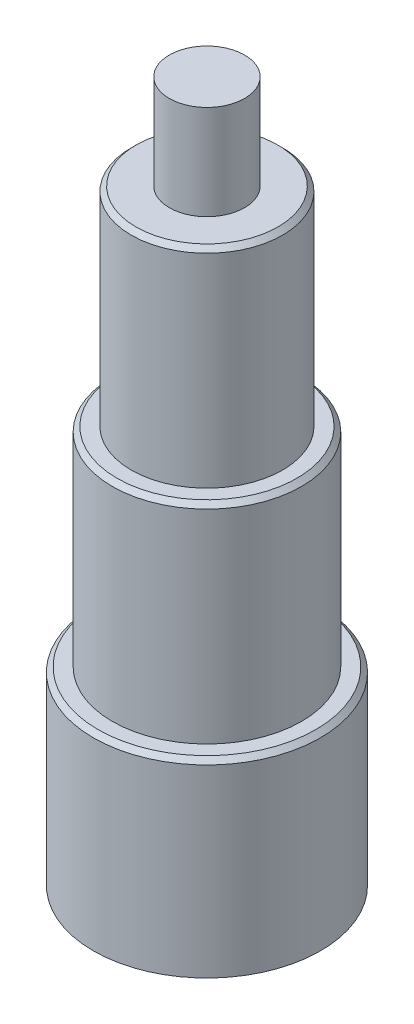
from build123d import *

# Parameters (mm, degrees)
SKETCH1_R                 = 6
BOSS_EXTRUDE1_DEPTH       = 10
SKETCH2_R                 = 5
BOSS_EXTRUDE2_DEPTH       = 11
SKETCH3_R                 = 4
BOSS_EXTRUDE3_DEPTH       = 11
SKETCH4_R                 = 1.989
BOSS_EXTRUDE4_DEPTH       = 5
CHAMFER1_SIZE             = 0.25
M4X0_7_TAPPED_HOLE1_D     = 3.3
M4X0_7_TAPPED_HOLE1_DEPTH = 14.1
M4X0_7_TAPPED_HOLE1_TIP   = 0.991420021


with BuildPart() as part:
    # Sketch1 → Boss-Extrude1 (new body)
    with BuildSketch(Plane(origin=(0, 0, 0), x_dir=(1, 0, 0), z_dir=(0, 1, 0))):
        with Locations(Location((0, 0, 0), (0, 0, 270))):
            Circle(SKETCH1_R)
    extrude(amount=BOSS_EXTRUDE1_DEPTH)

    # Sketch2 → Boss-Extrude2 (add)
    with BuildSketch(Plane(origin=(0, 10, 0), x_dir=(1, 0, 0), z_dir=(0, 1, 0))):
        with Locations(Location((0, 0, 0), (0, 0, 270))):
            Circle(SKETCH2_R)
    extrude(amount=BOSS_EXTRUDE2_DEPTH)

    # Sketch3 → Boss-Extrude3 (add)
    with BuildSketch(Plane(origin=(0, 21, 0), x_dir=(1, 0, 0), z_dir=(0, 1, 0))):
        with Locations(Location((0, 0, 0), (0, 0, 270))):
            Circle(SKETCH3_R)
    extrude(amount=BOSS_EXTRUDE3_DEPTH)

    # Sketch4 → Boss-Extrude4 (add)
    with BuildSketch(Plane(origin=(0, 32, 0), x_dir=(1, 0, 0), z_dir=(0, 1, 0))):
        with Locations(Location((0, 0, 0), (0, 0, 270))):
            Circle(SKETCH4_R)
    extrude(amount=BOSS_EXTRUDE4_DEPTH)

    # Chamfer1
    chamfer1_edges = [part.edges().sort_by_distance(p)[0] for p in [
        (0, 32, -4),
        (0, 10, -6),
        (0, 21, -5),
    ]]
    chamfer(chamfer1_edges, length=CHAMFER1_SIZE)

    # M4x0.7 Tapped Hole1
    with Locations(Plane(origin=(0, 0, 0), x_dir=(-1, 0, 0), z_dir=(0, -1, 0))):
        with Locations((0, 0)):
            Hole(M4X0_7_TAPPED_HOLE1_D / 2, depth=M4X0_7_TAPPED_HOLE1_DEPTH)
            with Locations((0, 0, -(M4X0_7_TAPPED_HOLE1_DEPTH + M4X0_7_TAPPED_HOLE1_TIP / 2))):  # 118° drill point
                Cone(0, M4X0_7_TAPPED_HOLE1_D / 2, M4X0_7_TAPPED_HOLE1_TIP, mode=Mode.SUBTRACT)


solid = part.part
